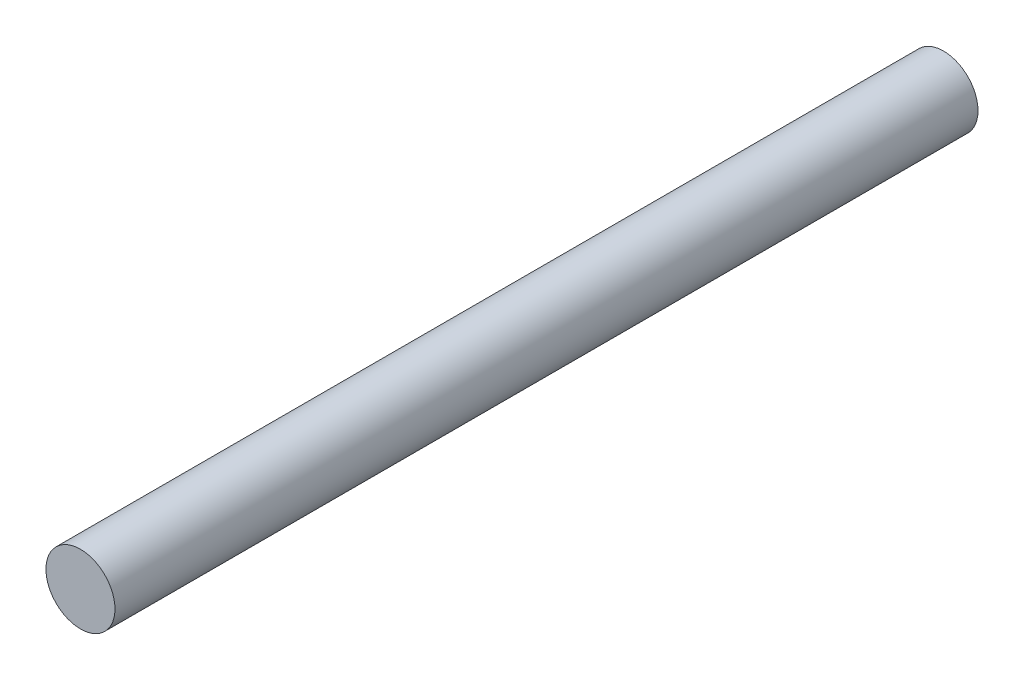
from build123d import *

# Parameters (mm, degrees)
SKETCH2_R          = 50.8
BASE_EXTRUDE_DEPTH = 1270


with BuildPart() as part:
    # Sketch2 → Base-Extrude (new body)
    with BuildSketch(Plane.XY):
        Circle(SKETCH2_R)
    extrude(amount=-BASE_EXTRUDE_DEPTH)


solid = part.part
